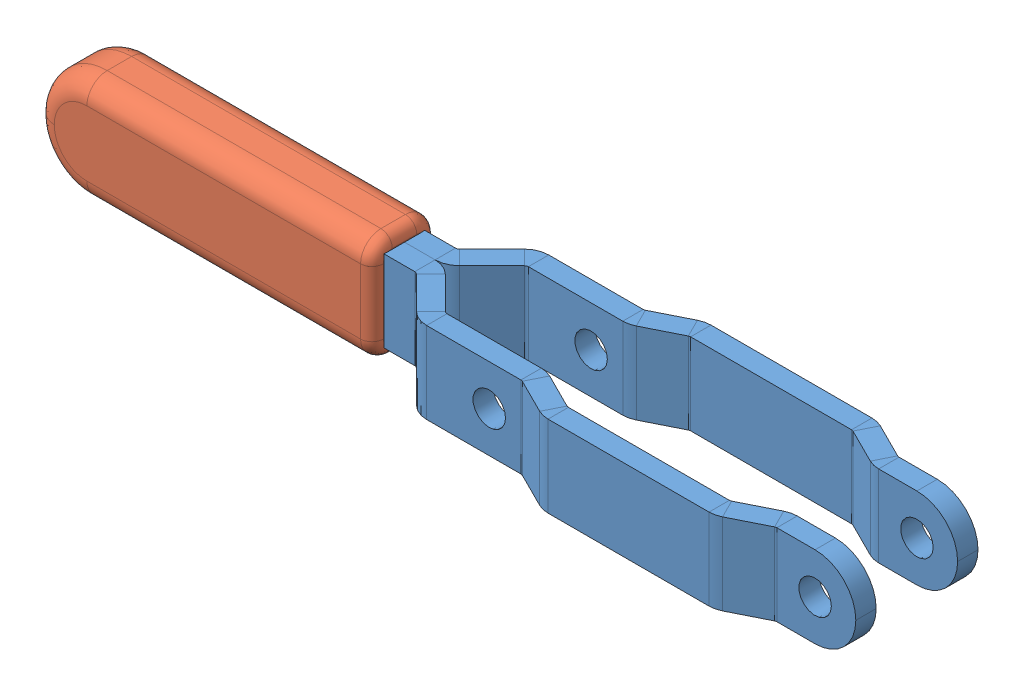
SolidWorks assembly handle sub-assy_&.sldasm, configuration Default (file format 15000). Lengths in mm.
Overall size (132.59 16.51 25.4).
3 component instances, 2 part files, 5 mates.
Components (placement in the parent):
- handle-half_&-1: handle-half_&.SLDPRT [Default] at (2.3468 22.924 12.7) size (130.68 12.7 12.7)
- handle-half_&-2: handle-half_&.SLDPRT [Default] at (2.3468 35.624 0) x (1 0 0) z (0 0 -1) size (130.68 12.7 12.7)
- sleeve_&-1: sleeve_&.sldprt [Default] at (-128.3362 22.924 3.175) size (52.77 16.51 10.16)
Mates (geometry in assembly coordinates):
- MateConcentric1: concentric anti-aligned: cylinder of handle-half_&-1 through (-4.0032 29.274 6.35) axis (0 0 1) radius 2.54; cylinder of handle-half_&-2 through (-4.0032 29.274 6.35) axis (0 0 -1) radius 2.54
- MateCoincident2: coincident anti-aligned: plane of handle-half_&-1 through (-71.1862 35.624 6.35) normal (0 0 -1); plane of handle-half_&-2 through (-71.1862 22.924 6.35) normal (0 0 1)
- MateConcentric5: concentric anti-aligned: cylinder of handle-half_&-1 through (-54.8032 29.274 6.35) axis (0 0 1) radius 2.54; cylinder of handle-half_&-2 through (-54.8032 29.274 6.35) axis (0 0 -1) radius 2.54
- MateCoincident3: coincident aligned: line of handle-half_&-1 through (-72.7643 35.624 9.525) axis (-1 0 0); line of sleeve_&-1 through (-77.5816 35.624 9.525) axis (-1 0 0)
- MateCoincident4: coincident aligned: line of handle-half_&-1 through (-121.9862 35.624 6.35) axis (0 0 1); line of sleeve_&-1 through (-121.9862 35.624 3.175) axis (0 0 1)
